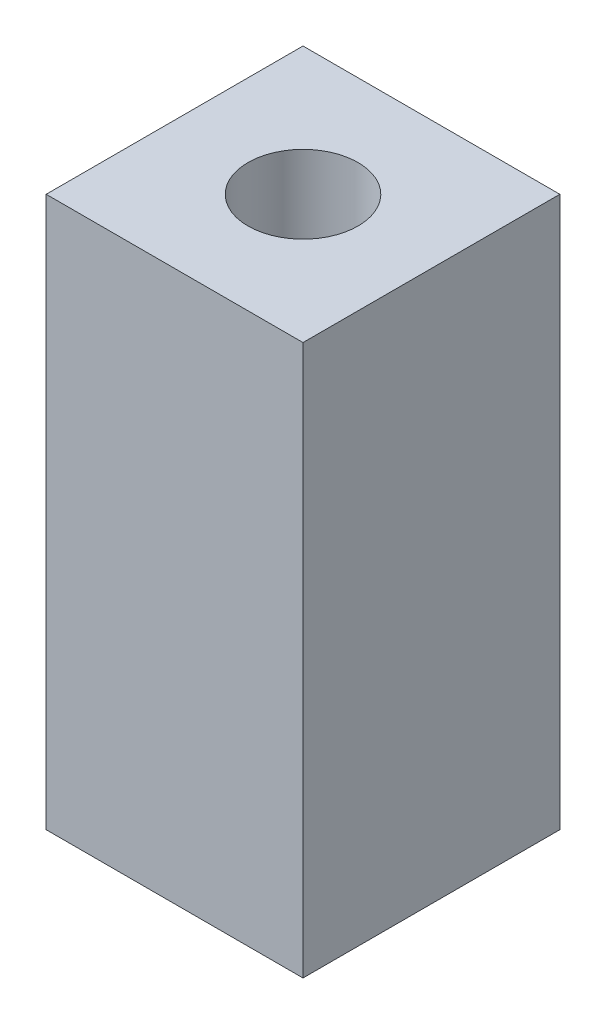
ISO-10303-21;
HEADER;
FILE_DESCRIPTION(('STEP AP214'),'2;1');
FILE_NAME('part.step','',(''),(''),'','','');
FILE_SCHEMA(('AUTOMOTIVE_DESIGN { 1 0 10303 214 1 1 1 1 }'));
ENDSEC;
DATA;
#1=APPLICATION_CONTEXT('core data for automotive mechanical design processes');
#2=APPLICATION_PROTOCOL_DEFINITION('international standard','automotive_design',2000,#1);
#3=PRODUCT_CONTEXT('',#1,'mechanical');
#4=PRODUCT('Part','Part','',(#3));
#5=PRODUCT_RELATED_PRODUCT_CATEGORY('part','',(#4));
#6=PRODUCT_DEFINITION_FORMATION('','',#4);
#7=PRODUCT_DEFINITION_CONTEXT('part definition',#1,'design');
#8=PRODUCT_DEFINITION('design','',#6,#7);
#9=PRODUCT_DEFINITION_SHAPE('','',#8);
#10=(LENGTH_UNIT() NAMED_UNIT(*) SI_UNIT(.MILLI.,.METRE.));
#11=(NAMED_UNIT(*) PLANE_ANGLE_UNIT() SI_UNIT($,.RADIAN.));
#12=(NAMED_UNIT(*) SI_UNIT($,.STERADIAN.) SOLID_ANGLE_UNIT());
#13=UNCERTAINTY_MEASURE_WITH_UNIT(LENGTH_MEASURE(1.E-05),#10,'distance_accuracy_value','');
#14=(GEOMETRIC_REPRESENTATION_CONTEXT(3) GLOBAL_UNCERTAINTY_ASSIGNED_CONTEXT((#13)) GLOBAL_UNIT_ASSIGNED_CONTEXT((#10,
#11,#12)) REPRESENTATION_CONTEXT('',''));
#15=CARTESIAN_POINT('',(0.,0.,0.));
#16=DIRECTION('',(0.,0.,1.));
#17=DIRECTION('',(1.,0.,0.));
#18=AXIS2_PLACEMENT_3D('',#15,#16,#17);
#19=CARTESIAN_POINT('',(0.,15.,0.));
#20=DIRECTION('',(0.,-1.,0.));
#21=DIRECTION('',(0.,0.,-1.));
#22=AXIS2_PLACEMENT_3D('',#19,#20,#21);
#23=PLANE('',#22);
#24=DIRECTION('',(0.,0.,-1.));
#25=VECTOR('',#24,1.);
#26=CARTESIAN_POINT('',(3.5,15.,3.5));
#27=LINE('',#26,#25);
#28=CARTESIAN_POINT('',(3.5,15.,3.5));
#29=VERTEX_POINT('',#28);
#30=CARTESIAN_POINT('',(3.5,15.,-3.5));
#31=VERTEX_POINT('',#30);
#32=EDGE_CURVE('E85',#29,#31,#27,.T.);
#33=ORIENTED_EDGE('',*,*,#32,.T.);
#34=DIRECTION('',(-1.,0.,0.));
#35=VECTOR('',#34,1.);
#36=CARTESIAN_POINT('',(-3.5,15.,-3.5));
#37=LINE('',#36,#35);
#38=CARTESIAN_POINT('',(-3.5,15.,-3.5));
#39=VERTEX_POINT('',#38);
#40=EDGE_CURVE('E80',#31,#39,#37,.T.);
#41=ORIENTED_EDGE('',*,*,#40,.T.);
#42=DIRECTION('',(0.,0.,1.));
#43=VECTOR('',#42,1.);
#44=CARTESIAN_POINT('',(-3.5,15.,3.5));
#45=LINE('',#44,#43);
#46=CARTESIAN_POINT('',(-3.5,15.,3.5));
#47=VERTEX_POINT('',#46);
#48=EDGE_CURVE('E83',#39,#47,#45,.T.);
#49=ORIENTED_EDGE('',*,*,#48,.T.);
#50=DIRECTION('',(1.,0.,0.));
#51=VECTOR('',#50,1.);
#52=CARTESIAN_POINT('',(-3.5,15.,3.5));
#53=LINE('',#52,#51);
#54=EDGE_CURVE('E50',#47,#29,#53,.T.);
#55=ORIENTED_EDGE('',*,*,#54,.T.);
#56=EDGE_LOOP('',(#33,#41,#49,#55));
#57=FACE_BOUND('',#56,.T.);
#58=CARTESIAN_POINT('',(0.,15.,0.));
#59=DIRECTION('',(0.,1.,0.));
#60=DIRECTION('',(0.,0.,1.));
#61=AXIS2_PLACEMENT_3D('',#58,#59,#60);
#62=CIRCLE('',#61,1.5);
#63=CARTESIAN_POINT('',(0.,15.,1.5));
#64=VERTEX_POINT('',#63);
#65=EDGE_CURVE('E100',#64,#64,#62,.T.);
#66=ORIENTED_EDGE('',*,*,#65,.F.);
#67=EDGE_LOOP('',(#66));
#68=FACE_BOUND('',#67,.T.);
#69=ADVANCED_FACE('F33',(#57,#68),#23,.F.);
#70=CARTESIAN_POINT('',(0.,0.,0.));
#71=DIRECTION('',(0.,-1.,0.));
#72=DIRECTION('',(0.,0.,-1.));
#73=AXIS2_PLACEMENT_3D('',#70,#71,#72);
#74=PLANE('',#73);
#75=DIRECTION('',(0.,0.,-1.));
#76=VECTOR('',#75,1.);
#77=CARTESIAN_POINT('',(3.5,0.,3.5));
#78=LINE('',#77,#76);
#79=CARTESIAN_POINT('',(3.5,0.,3.5));
#80=VERTEX_POINT('',#79);
#81=CARTESIAN_POINT('',(3.5,0.,-3.5));
#82=VERTEX_POINT('',#81);
#83=EDGE_CURVE('E97',#80,#82,#78,.T.);
#84=ORIENTED_EDGE('',*,*,#83,.F.);
#85=DIRECTION('',(1.,0.,0.));
#86=VECTOR('',#85,1.);
#87=CARTESIAN_POINT('',(-3.5,0.,3.5));
#88=LINE('',#87,#86);
#89=CARTESIAN_POINT('',(-3.5,0.,3.5));
#90=VERTEX_POINT('',#89);
#91=EDGE_CURVE('E73',#90,#80,#88,.T.);
#92=ORIENTED_EDGE('',*,*,#91,.F.);
#93=DIRECTION('',(0.,0.,1.));
#94=VECTOR('',#93,1.);
#95=CARTESIAN_POINT('',(-3.5,0.,3.5));
#96=LINE('',#95,#94);
#97=CARTESIAN_POINT('',(-3.5,0.,-3.5));
#98=VERTEX_POINT('',#97);
#99=EDGE_CURVE('E67',#98,#90,#96,.T.);
#100=ORIENTED_EDGE('',*,*,#99,.F.);
#101=DIRECTION('',(-1.,0.,0.));
#102=VECTOR('',#101,1.);
#103=CARTESIAN_POINT('',(-3.5,0.,-3.5));
#104=LINE('',#103,#102);
#105=EDGE_CURVE('E89',#82,#98,#104,.T.);
#106=ORIENTED_EDGE('',*,*,#105,.F.);
#107=EDGE_LOOP('',(#84,#92,#100,#106));
#108=FACE_BOUND('',#107,.T.);
#109=CARTESIAN_POINT('',(0.,0.,0.));
#110=DIRECTION('',(0.,1.,0.));
#111=DIRECTION('',(0.,0.,1.));
#112=AXIS2_PLACEMENT_3D('',#109,#110,#111);
#113=CIRCLE('',#112,1.5);
#114=CARTESIAN_POINT('',(0.,0.,1.5));
#115=VERTEX_POINT('',#114);
#116=EDGE_CURVE('E112',#115,#115,#113,.T.);
#117=ORIENTED_EDGE('',*,*,#116,.T.);
#118=EDGE_LOOP('',(#117));
#119=FACE_BOUND('',#118,.T.);
#120=ADVANCED_FACE('F108',(#108,#119),#74,.T.);
#121=CARTESIAN_POINT('',(3.5,15.,3.5));
#122=DIRECTION('',(-1.,0.,0.));
#123=DIRECTION('',(0.,0.,1.));
#124=AXIS2_PLACEMENT_3D('',#121,#122,#123);
#125=PLANE('',#124);
#126=ORIENTED_EDGE('',*,*,#83,.T.);
#127=DIRECTION('',(0.,-1.,0.));
#128=VECTOR('',#127,1.);
#129=CARTESIAN_POINT('',(3.5,15.,-3.5));
#130=LINE('',#129,#128);
#131=EDGE_CURVE('E11',#31,#82,#130,.T.);
#132=ORIENTED_EDGE('',*,*,#131,.F.);
#133=ORIENTED_EDGE('',*,*,#32,.F.);
#134=DIRECTION('',(0.,-1.,0.));
#135=VECTOR('',#134,1.);
#136=CARTESIAN_POINT('',(3.5,15.,3.5));
#137=LINE('',#136,#135);
#138=EDGE_CURVE('E93',#29,#80,#137,.T.);
#139=ORIENTED_EDGE('',*,*,#138,.T.);
#140=EDGE_LOOP('',(#126,#132,#133,#139));
#141=FACE_BOUND('',#140,.T.);
#142=ADVANCED_FACE('F35',(#141),#125,.F.);
#143=CARTESIAN_POINT('',(-3.5,15.,-3.5));
#144=DIRECTION('',(0.,0.,1.));
#145=DIRECTION('',(1.,0.,0.));
#146=AXIS2_PLACEMENT_3D('',#143,#144,#145);
#147=PLANE('',#146);
#148=ORIENTED_EDGE('',*,*,#105,.T.);
#149=DIRECTION('',(0.,-1.,0.));
#150=VECTOR('',#149,1.);
#151=CARTESIAN_POINT('',(-3.5,15.,-3.5));
#152=LINE('',#151,#150);
#153=EDGE_CURVE('E42',#39,#98,#152,.T.);
#154=ORIENTED_EDGE('',*,*,#153,.F.);
#155=ORIENTED_EDGE('',*,*,#40,.F.);
#156=ORIENTED_EDGE('',*,*,#131,.T.);
#157=EDGE_LOOP('',(#148,#154,#155,#156));
#158=FACE_BOUND('',#157,.T.);
#159=ADVANCED_FACE('F88',(#158),#147,.F.);
#160=CARTESIAN_POINT('',(-3.5,15.,3.5));
#161=DIRECTION('',(1.,0.,0.));
#162=DIRECTION('',(0.,0.,-1.));
#163=AXIS2_PLACEMENT_3D('',#160,#161,#162);
#164=PLANE('',#163);
#165=ORIENTED_EDGE('',*,*,#99,.T.);
#166=DIRECTION('',(0.,-1.,0.));
#167=VECTOR('',#166,1.);
#168=CARTESIAN_POINT('',(-3.5,15.,3.5));
#169=LINE('',#168,#167);
#170=EDGE_CURVE('E90',#47,#90,#169,.T.);
#171=ORIENTED_EDGE('',*,*,#170,.F.);
#172=ORIENTED_EDGE('',*,*,#48,.F.);
#173=ORIENTED_EDGE('',*,*,#153,.T.);
#174=EDGE_LOOP('',(#165,#171,#172,#173));
#175=FACE_BOUND('',#174,.T.);
#176=ADVANCED_FACE('F91',(#175),#164,.F.);
#177=CARTESIAN_POINT('',(-3.5,15.,3.5));
#178=DIRECTION('',(0.,0.,-1.));
#179=DIRECTION('',(-1.,0.,0.));
#180=AXIS2_PLACEMENT_3D('',#177,#178,#179);
#181=PLANE('',#180);
#182=ORIENTED_EDGE('',*,*,#91,.T.);
#183=ORIENTED_EDGE('',*,*,#138,.F.);
#184=ORIENTED_EDGE('',*,*,#54,.F.);
#185=ORIENTED_EDGE('',*,*,#170,.T.);
#186=EDGE_LOOP('',(#182,#183,#184,#185));
#187=FACE_BOUND('',#186,.T.);
#188=ADVANCED_FACE('F105',(#187),#181,.F.);
#189=CARTESIAN_POINT('',(0.,15.,0.));
#190=DIRECTION('',(0.,-1.,0.));
#191=DIRECTION('',(0.,0.,-1.));
#192=AXIS2_PLACEMENT_3D('',#189,#190,#191);
#193=CYLINDRICAL_SURFACE('',#192,1.5);
#194=ORIENTED_EDGE('',*,*,#65,.T.);
#195=EDGE_LOOP('',(#194));
#196=FACE_BOUND('',#195,.T.);
#197=ORIENTED_EDGE('',*,*,#116,.F.);
#198=EDGE_LOOP('',(#197));
#199=FACE_BOUND('',#198,.T.);
#200=ADVANCED_FACE('F118',(#196,#199),#193,.F.);
#201=CLOSED_SHELL('',(#69,#120,#142,#159,#176,#188,#200));
#202=MANIFOLD_SOLID_BREP('B2',#201);
#203=ADVANCED_BREP_SHAPE_REPRESENTATION('',(#18,#202),#14);
#204=SHAPE_DEFINITION_REPRESENTATION(#9,#203);
ENDSEC;
END-ISO-10303-21;
